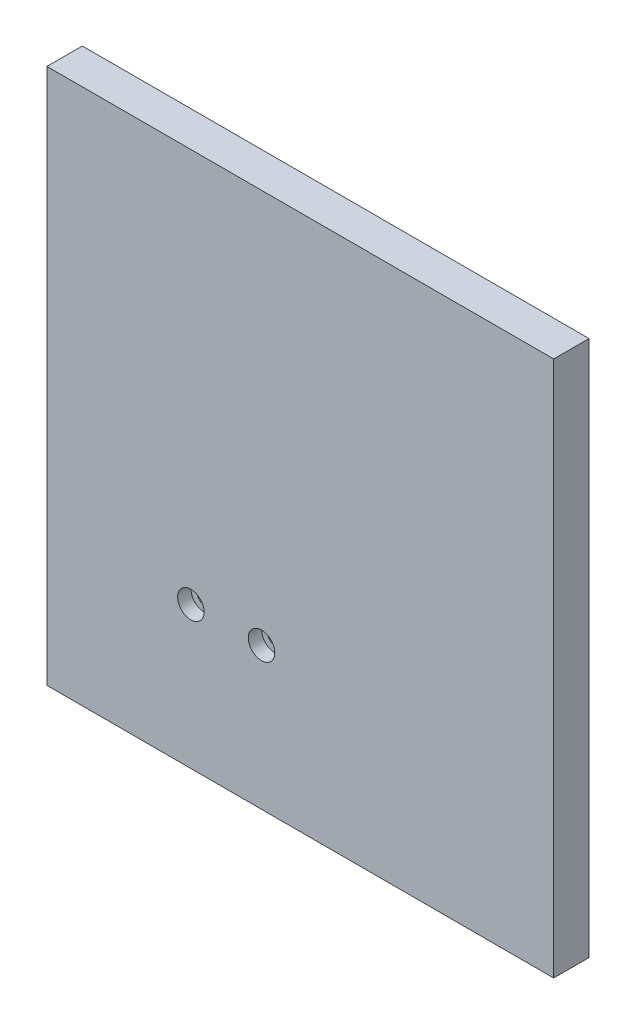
ISO-10303-21;
HEADER;
FILE_DESCRIPTION(('STEP AP214'),'2;1');
FILE_NAME('part.step','',(''),(''),'','','');
FILE_SCHEMA(('AUTOMOTIVE_DESIGN { 1 0 10303 214 1 1 1 1 }'));
ENDSEC;
DATA;
#1=APPLICATION_CONTEXT('core data for automotive mechanical design processes');
#2=APPLICATION_PROTOCOL_DEFINITION('international standard','automotive_design',2000,#1);
#3=PRODUCT_CONTEXT('',#1,'mechanical');
#4=PRODUCT('Part','Part','',(#3));
#5=PRODUCT_RELATED_PRODUCT_CATEGORY('part','',(#4));
#6=PRODUCT_DEFINITION_FORMATION('','',#4);
#7=PRODUCT_DEFINITION_CONTEXT('part definition',#1,'design');
#8=PRODUCT_DEFINITION('design','',#6,#7);
#9=PRODUCT_DEFINITION_SHAPE('','',#8);
#10=(LENGTH_UNIT() NAMED_UNIT(*) SI_UNIT(.MILLI.,.METRE.));
#11=(NAMED_UNIT(*) PLANE_ANGLE_UNIT() SI_UNIT($,.RADIAN.));
#12=(NAMED_UNIT(*) SI_UNIT($,.STERADIAN.) SOLID_ANGLE_UNIT());
#13=UNCERTAINTY_MEASURE_WITH_UNIT(LENGTH_MEASURE(1.E-05),#10,'distance_accuracy_value','');
#14=(GEOMETRIC_REPRESENTATION_CONTEXT(3) GLOBAL_UNCERTAINTY_ASSIGNED_CONTEXT((#13)) GLOBAL_UNIT_ASSIGNED_CONTEXT((#10,
#11,#12)) REPRESENTATION_CONTEXT('',''));
#15=CARTESIAN_POINT('',(0.,0.,0.));
#16=DIRECTION('',(0.,0.,1.));
#17=DIRECTION('',(1.,0.,0.));
#18=AXIS2_PLACEMENT_3D('',#15,#16,#17);
#19=CARTESIAN_POINT('',(-45.372249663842,146.756077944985,12.7));
#20=DIRECTION('',(1.,0.,0.));
#21=DIRECTION('',(0.,1.,0.));
#22=AXIS2_PLACEMENT_3D('',#19,#20,#21);
#23=PLANE('',#22);
#24=DIRECTION('',(0.,-1.,0.));
#25=VECTOR('',#24,1.);
#26=CARTESIAN_POINT('',(-45.372249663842,146.756077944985,0.));
#27=LINE('',#26,#25);
#28=CARTESIAN_POINT('',(-45.372249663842,146.756077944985,0.));
#29=VERTEX_POINT('',#28);
#30=CARTESIAN_POINT('',(-45.372249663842,-45.9615395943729,0.));
#31=VERTEX_POINT('',#30);
#32=EDGE_CURVE('E94',#29,#31,#27,.T.);
#33=ORIENTED_EDGE('',*,*,#32,.T.);
#34=DIRECTION('',(0.,0.,-1.));
#35=VECTOR('',#34,1.);
#36=CARTESIAN_POINT('',(-45.372249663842,-45.9615395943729,12.7));
#37=LINE('',#36,#35);
#38=CARTESIAN_POINT('',(-45.372249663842,-45.9615395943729,12.7));
#39=VERTEX_POINT('',#38);
#40=EDGE_CURVE('E11',#39,#31,#37,.T.);
#41=ORIENTED_EDGE('',*,*,#40,.F.);
#42=DIRECTION('',(0.,-1.,0.));
#43=VECTOR('',#42,1.);
#44=CARTESIAN_POINT('',(-45.372249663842,146.756077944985,12.7));
#45=LINE('',#44,#43);
#46=CARTESIAN_POINT('',(-45.372249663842,146.756077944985,12.7));
#47=VERTEX_POINT('',#46);
#48=EDGE_CURVE('E82',#47,#39,#45,.T.);
#49=ORIENTED_EDGE('',*,*,#48,.F.);
#50=DIRECTION('',(0.,0.,-1.));
#51=VECTOR('',#50,1.);
#52=CARTESIAN_POINT('',(-45.372249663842,146.756077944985,12.7));
#53=LINE('',#52,#51);
#54=EDGE_CURVE('E90',#47,#29,#53,.T.);
#55=ORIENTED_EDGE('',*,*,#54,.T.);
#56=EDGE_LOOP('',(#33,#41,#49,#55));
#57=FACE_BOUND('',#56,.T.);
#58=ADVANCED_FACE('F31',(#57),#23,.F.);
#59=CARTESIAN_POINT('',(-45.372249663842,-45.9615395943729,12.7));
#60=DIRECTION('',(0.,1.,0.));
#61=DIRECTION('',(0.,0.,1.));
#62=AXIS2_PLACEMENT_3D('',#59,#60,#61);
#63=PLANE('',#62);
#64=DIRECTION('',(1.,0.,0.));
#65=VECTOR('',#64,1.);
#66=CARTESIAN_POINT('',(-45.372249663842,-45.9615395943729,0.));
#67=LINE('',#66,#65);
#68=CARTESIAN_POINT('',(136.782420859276,-45.9615395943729,0.));
#69=VERTEX_POINT('',#68);
#70=EDGE_CURVE('E86',#31,#69,#67,.T.);
#71=ORIENTED_EDGE('',*,*,#70,.T.);
#72=DIRECTION('',(0.,0.,-1.));
#73=VECTOR('',#72,1.);
#74=CARTESIAN_POINT('',(136.782420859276,-45.9615395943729,12.7));
#75=LINE('',#74,#73);
#76=CARTESIAN_POINT('',(136.782420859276,-45.9615395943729,12.7));
#77=VERTEX_POINT('',#76);
#78=EDGE_CURVE('E39',#77,#69,#75,.T.);
#79=ORIENTED_EDGE('',*,*,#78,.F.);
#80=DIRECTION('',(1.,0.,0.));
#81=VECTOR('',#80,1.);
#82=CARTESIAN_POINT('',(-45.372249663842,-45.9615395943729,12.7));
#83=LINE('',#82,#81);
#84=EDGE_CURVE('E77',#39,#77,#83,.T.);
#85=ORIENTED_EDGE('',*,*,#84,.F.);
#86=ORIENTED_EDGE('',*,*,#40,.T.);
#87=EDGE_LOOP('',(#71,#79,#85,#86));
#88=FACE_BOUND('',#87,.T.);
#89=ADVANCED_FACE('F85',(#88),#63,.F.);
#90=CARTESIAN_POINT('',(136.782420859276,146.756077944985,12.7));
#91=DIRECTION('',(-1.,0.,0.));
#92=DIRECTION('',(0.,0.,1.));
#93=AXIS2_PLACEMENT_3D('',#90,#91,#92);
#94=PLANE('',#93);
#95=DIRECTION('',(0.,1.,0.));
#96=VECTOR('',#95,1.);
#97=CARTESIAN_POINT('',(136.782420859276,146.756077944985,0.));
#98=LINE('',#97,#96);
#99=CARTESIAN_POINT('',(136.782420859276,146.756077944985,0.));
#100=VERTEX_POINT('',#99);
#101=EDGE_CURVE('E64',#69,#100,#98,.T.);
#102=ORIENTED_EDGE('',*,*,#101,.T.);
#103=DIRECTION('',(0.,0.,-1.));
#104=VECTOR('',#103,1.);
#105=CARTESIAN_POINT('',(136.782420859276,146.756077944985,12.7));
#106=LINE('',#105,#104);
#107=CARTESIAN_POINT('',(136.782420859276,146.756077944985,12.7));
#108=VERTEX_POINT('',#107);
#109=EDGE_CURVE('E87',#108,#100,#106,.T.);
#110=ORIENTED_EDGE('',*,*,#109,.F.);
#111=DIRECTION('',(0.,1.,0.));
#112=VECTOR('',#111,1.);
#113=CARTESIAN_POINT('',(136.782420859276,146.756077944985,12.7));
#114=LINE('',#113,#112);
#115=EDGE_CURVE('E80',#77,#108,#114,.T.);
#116=ORIENTED_EDGE('',*,*,#115,.F.);
#117=ORIENTED_EDGE('',*,*,#78,.T.);
#118=EDGE_LOOP('',(#102,#110,#116,#117));
#119=FACE_BOUND('',#118,.T.);
#120=ADVANCED_FACE('F88',(#119),#94,.F.);
#121=CARTESIAN_POINT('',(-45.372249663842,146.756077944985,12.7));
#122=DIRECTION('',(0.,-1.,0.));
#123=DIRECTION('',(0.,0.,-1.));
#124=AXIS2_PLACEMENT_3D('',#121,#122,#123);
#125=PLANE('',#124);
#126=DIRECTION('',(-1.,0.,0.));
#127=VECTOR('',#126,1.);
#128=CARTESIAN_POINT('',(-45.372249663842,146.756077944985,0.));
#129=LINE('',#128,#127);
#130=EDGE_CURVE('E70',#100,#29,#129,.T.);
#131=ORIENTED_EDGE('',*,*,#130,.T.);
#132=ORIENTED_EDGE('',*,*,#54,.F.);
#133=DIRECTION('',(-1.,0.,0.));
#134=VECTOR('',#133,1.);
#135=CARTESIAN_POINT('',(-45.372249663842,146.756077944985,12.7));
#136=LINE('',#135,#134);
#137=EDGE_CURVE('E47',#108,#47,#136,.T.);
#138=ORIENTED_EDGE('',*,*,#137,.F.);
#139=ORIENTED_EDGE('',*,*,#109,.T.);
#140=EDGE_LOOP('',(#131,#132,#138,#139));
#141=FACE_BOUND('',#140,.T.);
#142=ADVANCED_FACE('F102',(#141),#125,.F.);
#143=CARTESIAN_POINT('',(-45.372249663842,-45.9615395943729,12.7));
#144=DIRECTION('',(0.,0.,1.));
#145=DIRECTION('',(1.,0.,0.));
#146=AXIS2_PLACEMENT_3D('',#143,#144,#145);
#147=PLANE('',#146);
#148=CARTESIAN_POINT('',(31.75,5.08,12.7));
#149=DIRECTION('',(0.,0.,1.));
#150=DIRECTION('',(1.,0.,0.));
#151=AXIS2_PLACEMENT_3D('',#148,#149,#150);
#152=CIRCLE('',#151,4.7625);
#153=CARTESIAN_POINT('',(36.5125,5.08,12.7));
#154=VERTEX_POINT('',#153);
#155=EDGE_CURVE('E119',#154,#154,#152,.T.);
#156=ORIENTED_EDGE('',*,*,#155,.F.);
#157=EDGE_LOOP('',(#156));
#158=FACE_BOUND('',#157,.T.);
#159=CARTESIAN_POINT('',(6.35,5.08,12.7));
#160=DIRECTION('',(0.,0.,1.));
#161=DIRECTION('',(1.,0.,0.));
#162=AXIS2_PLACEMENT_3D('',#159,#160,#161);
#163=CIRCLE('',#162,4.7625);
#164=CARTESIAN_POINT('',(11.1125,5.08,12.7));
#165=VERTEX_POINT('',#164);
#166=EDGE_CURVE('E97',#165,#165,#163,.T.);
#167=ORIENTED_EDGE('',*,*,#166,.F.);
#168=EDGE_LOOP('',(#167));
#169=FACE_BOUND('',#168,.T.);
#170=ORIENTED_EDGE('',*,*,#48,.T.);
#171=ORIENTED_EDGE('',*,*,#84,.T.);
#172=ORIENTED_EDGE('',*,*,#115,.T.);
#173=ORIENTED_EDGE('',*,*,#137,.T.);
#174=EDGE_LOOP('',(#170,#171,#172,#173));
#175=FACE_BOUND('',#174,.T.);
#176=ADVANCED_FACE('F78',(#158,#169,#175),#147,.T.);
#177=CARTESIAN_POINT('',(-45.372249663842,-45.9615395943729,0.));
#178=DIRECTION('',(0.,0.,1.));
#179=DIRECTION('',(1.,0.,0.));
#180=AXIS2_PLACEMENT_3D('',#177,#178,#179);
#181=PLANE('',#180);
#182=CARTESIAN_POINT('',(31.75,5.08,0.));
#183=DIRECTION('',(0.,0.,1.));
#184=DIRECTION('',(1.,0.,0.));
#185=AXIS2_PLACEMENT_3D('',#182,#183,#184);
#186=CIRCLE('',#185,2.5527);
#187=CARTESIAN_POINT('',(34.3027,5.08,0.));
#188=VERTEX_POINT('',#187);
#189=EDGE_CURVE('E128',#188,#188,#186,.T.);
#190=ORIENTED_EDGE('',*,*,#189,.T.);
#191=EDGE_LOOP('',(#190));
#192=FACE_BOUND('',#191,.T.);
#193=CARTESIAN_POINT('',(6.35,5.08,0.));
#194=DIRECTION('',(0.,0.,1.));
#195=DIRECTION('',(1.,0.,0.));
#196=AXIS2_PLACEMENT_3D('',#193,#194,#195);
#197=CIRCLE('',#196,2.5527);
#198=CARTESIAN_POINT('',(8.9027,5.08,0.));
#199=VERTEX_POINT('',#198);
#200=EDGE_CURVE('E116',#199,#199,#197,.T.);
#201=ORIENTED_EDGE('',*,*,#200,.T.);
#202=EDGE_LOOP('',(#201));
#203=FACE_BOUND('',#202,.T.);
#204=ORIENTED_EDGE('',*,*,#32,.F.);
#205=ORIENTED_EDGE('',*,*,#130,.F.);
#206=ORIENTED_EDGE('',*,*,#101,.F.);
#207=ORIENTED_EDGE('',*,*,#70,.F.);
#208=EDGE_LOOP('',(#204,#205,#206,#207));
#209=FACE_BOUND('',#208,.T.);
#210=ADVANCED_FACE('F105',(#192,#203,#209),#181,.F.);
#211=CARTESIAN_POINT('',(6.35,5.08,12.7));
#212=DIRECTION('',(0.,0.,1.));
#213=DIRECTION('',(1.,0.,0.));
#214=AXIS2_PLACEMENT_3D('',#211,#212,#213);
#215=CYLINDRICAL_SURFACE('',#214,4.7625);
#216=CARTESIAN_POINT('',(6.35,5.08,7.874));
#217=DIRECTION('',(0.,0.,1.));
#218=DIRECTION('',(1.,0.,0.));
#219=AXIS2_PLACEMENT_3D('',#216,#217,#218);
#220=CIRCLE('',#219,4.7625);
#221=CARTESIAN_POINT('',(11.1125,5.08,7.874));
#222=VERTEX_POINT('',#221);
#223=EDGE_CURVE('E110',#222,#222,#220,.T.);
#224=ORIENTED_EDGE('',*,*,#223,.F.);
#225=EDGE_LOOP('',(#224));
#226=FACE_BOUND('',#225,.T.);
#227=ORIENTED_EDGE('',*,*,#166,.T.);
#228=EDGE_LOOP('',(#227));
#229=FACE_BOUND('',#228,.T.);
#230=ADVANCED_FACE('F158',(#226,#229),#215,.F.);
#231=CARTESIAN_POINT('',(8.9027,5.08,7.874));
#232=DIRECTION('',(0.,0.,-1.));
#233=DIRECTION('',(-1.,0.,0.));
#234=AXIS2_PLACEMENT_3D('',#231,#232,#233);
#235=PLANE('',#234);
#236=CARTESIAN_POINT('',(6.35,5.08,7.874));
#237=DIRECTION('',(0.,0.,1.));
#238=DIRECTION('',(1.,0.,0.));
#239=AXIS2_PLACEMENT_3D('',#236,#237,#238);
#240=CIRCLE('',#239,2.5527);
#241=CARTESIAN_POINT('',(8.9027,5.08,7.874));
#242=VERTEX_POINT('',#241);
#243=EDGE_CURVE('E113',#242,#242,#240,.T.);
#244=ORIENTED_EDGE('',*,*,#243,.F.);
#245=EDGE_LOOP('',(#244));
#246=FACE_BOUND('',#245,.T.);
#247=ORIENTED_EDGE('',*,*,#223,.T.);
#248=EDGE_LOOP('',(#247));
#249=FACE_BOUND('',#248,.T.);
#250=ADVANCED_FACE('F160',(#246,#249),#235,.F.);
#251=CARTESIAN_POINT('',(6.35,5.08,12.7));
#252=DIRECTION('',(0.,0.,1.));
#253=DIRECTION('',(1.,0.,0.));
#254=AXIS2_PLACEMENT_3D('',#251,#252,#253);
#255=CYLINDRICAL_SURFACE('',#254,2.5527);
#256=ORIENTED_EDGE('',*,*,#200,.F.);
#257=EDGE_LOOP('',(#256));
#258=FACE_BOUND('',#257,.T.);
#259=ORIENTED_EDGE('',*,*,#243,.T.);
#260=EDGE_LOOP('',(#259));
#261=FACE_BOUND('',#260,.T.);
#262=ADVANCED_FACE('F149',(#258,#261),#255,.F.);
#263=CARTESIAN_POINT('',(31.75,5.08,12.7));
#264=DIRECTION('',(0.,0.,1.));
#265=DIRECTION('',(1.,0.,0.));
#266=AXIS2_PLACEMENT_3D('',#263,#264,#265);
#267=CYLINDRICAL_SURFACE('',#266,4.7625);
#268=CARTESIAN_POINT('',(31.75,5.08,7.874));
#269=DIRECTION('',(0.,0.,1.));
#270=DIRECTION('',(1.,0.,0.));
#271=AXIS2_PLACEMENT_3D('',#268,#269,#270);
#272=CIRCLE('',#271,4.7625);
#273=CARTESIAN_POINT('',(36.5125,5.08,7.874));
#274=VERTEX_POINT('',#273);
#275=EDGE_CURVE('E122',#274,#274,#272,.T.);
#276=ORIENTED_EDGE('',*,*,#275,.F.);
#277=EDGE_LOOP('',(#276));
#278=FACE_BOUND('',#277,.T.);
#279=ORIENTED_EDGE('',*,*,#155,.T.);
#280=EDGE_LOOP('',(#279));
#281=FACE_BOUND('',#280,.T.);
#282=ADVANCED_FACE('F143',(#278,#281),#267,.F.);
#283=CARTESIAN_POINT('',(34.3027,5.08,7.874));
#284=DIRECTION('',(0.,0.,-1.));
#285=DIRECTION('',(-1.,0.,0.));
#286=AXIS2_PLACEMENT_3D('',#283,#284,#285);
#287=PLANE('',#286);
#288=CARTESIAN_POINT('',(31.75,5.08,7.874));
#289=DIRECTION('',(0.,0.,1.));
#290=DIRECTION('',(1.,0.,0.));
#291=AXIS2_PLACEMENT_3D('',#288,#289,#290);
#292=CIRCLE('',#291,2.5527);
#293=CARTESIAN_POINT('',(34.3027,5.08,7.874));
#294=VERTEX_POINT('',#293);
#295=EDGE_CURVE('E125',#294,#294,#292,.T.);
#296=ORIENTED_EDGE('',*,*,#295,.F.);
#297=EDGE_LOOP('',(#296));
#298=FACE_BOUND('',#297,.T.);
#299=ORIENTED_EDGE('',*,*,#275,.T.);
#300=EDGE_LOOP('',(#299));
#301=FACE_BOUND('',#300,.T.);
#302=ADVANCED_FACE('F137',(#298,#301),#287,.F.);
#303=CARTESIAN_POINT('',(31.75,5.08,12.7));
#304=DIRECTION('',(0.,0.,1.));
#305=DIRECTION('',(1.,0.,0.));
#306=AXIS2_PLACEMENT_3D('',#303,#304,#305);
#307=CYLINDRICAL_SURFACE('',#306,2.5527);
#308=ORIENTED_EDGE('',*,*,#189,.F.);
#309=EDGE_LOOP('',(#308));
#310=FACE_BOUND('',#309,.T.);
#311=ORIENTED_EDGE('',*,*,#295,.T.);
#312=EDGE_LOOP('',(#311));
#313=FACE_BOUND('',#312,.T.);
#314=ADVANCED_FACE('F134',(#310,#313),#307,.F.);
#315=CLOSED_SHELL('',(#58,#89,#120,#142,#176,#210,#230,#250,#262,#282,#302,#314));
#316=MANIFOLD_SOLID_BREP('B2',#315);
#317=ADVANCED_BREP_SHAPE_REPRESENTATION('',(#18,#316),#14);
#318=SHAPE_DEFINITION_REPRESENTATION(#9,#317);
ENDSEC;
END-ISO-10303-21;
